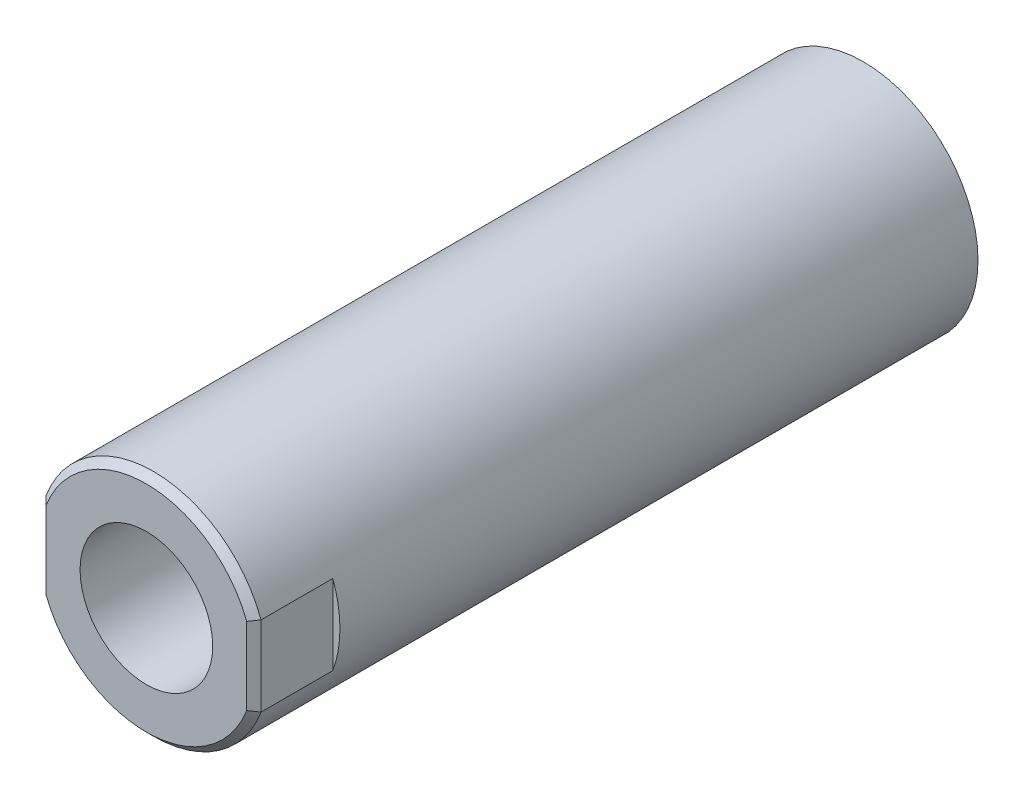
ISO-10303-21;
HEADER;
FILE_DESCRIPTION(('STEP AP214'),'2;1');
FILE_NAME('part.step','',(''),(''),'','','');
FILE_SCHEMA(('AUTOMOTIVE_DESIGN { 1 0 10303 214 1 1 1 1 }'));
ENDSEC;
DATA;
#1=APPLICATION_CONTEXT('core data for automotive mechanical design processes');
#2=APPLICATION_PROTOCOL_DEFINITION('international standard','automotive_design',2000,#1);
#3=PRODUCT_CONTEXT('',#1,'mechanical');
#4=PRODUCT('Part','Part','',(#3));
#5=PRODUCT_RELATED_PRODUCT_CATEGORY('part','',(#4));
#6=PRODUCT_DEFINITION_FORMATION('','',#4);
#7=PRODUCT_DEFINITION_CONTEXT('part definition',#1,'design');
#8=PRODUCT_DEFINITION('design','',#6,#7);
#9=PRODUCT_DEFINITION_SHAPE('','',#8);
#10=(LENGTH_UNIT() NAMED_UNIT(*) SI_UNIT(.MILLI.,.METRE.));
#11=(NAMED_UNIT(*) PLANE_ANGLE_UNIT() SI_UNIT($,.RADIAN.));
#12=(NAMED_UNIT(*) SI_UNIT($,.STERADIAN.) SOLID_ANGLE_UNIT());
#13=UNCERTAINTY_MEASURE_WITH_UNIT(LENGTH_MEASURE(1.E-05),#10,'distance_accuracy_value','');
#14=(GEOMETRIC_REPRESENTATION_CONTEXT(3) GLOBAL_UNCERTAINTY_ASSIGNED_CONTEXT((#13)) GLOBAL_UNIT_ASSIGNED_CONTEXT((#10,
#11,#12)) REPRESENTATION_CONTEXT('',''));
#15=CARTESIAN_POINT('',(0.,0.,0.));
#16=DIRECTION('',(0.,0.,1.));
#17=DIRECTION('',(1.,0.,0.));
#18=AXIS2_PLACEMENT_3D('',#15,#16,#17);
#19=CARTESIAN_POINT('',(0.,0.,-100.));
#20=DIRECTION('',(0.,0.,1.));
#21=DIRECTION('',(1.,0.,0.));
#22=AXIS2_PLACEMENT_3D('',#19,#20,#21);
#23=PLANE('',#22);
#24=CARTESIAN_POINT('',(0.,0.,-100.));
#25=DIRECTION('',(0.,0.,1.));
#26=DIRECTION('',(1.,0.,0.));
#27=AXIS2_PLACEMENT_3D('',#24,#25,#26);
#28=CIRCLE('',#27,16.);
#29=CARTESIAN_POINT('',(16.,0.,-100.));
#30=VERTEX_POINT('',#29);
#31=EDGE_CURVE('E210',#30,#30,#28,.T.);
#32=ORIENTED_EDGE('',*,*,#31,.F.);
#33=EDGE_LOOP('',(#32));
#34=FACE_BOUND('',#33,.T.);
#35=ADVANCED_FACE('F39',(#34),#23,.F.);
#36=CARTESIAN_POINT('',(15.,-10.5,-11.));
#37=DIRECTION('',(0.,0.,-1.));
#38=DIRECTION('',(-1.,0.,0.));
#39=AXIS2_PLACEMENT_3D('',#36,#37,#38);
#40=PLANE('',#39);
#41=CARTESIAN_POINT('',(0.,0.,-11.));
#42=DIRECTION('',(0.,0.,-1.));
#43=DIRECTION('',(-1.,0.,0.));
#44=AXIS2_PLACEMENT_3D('',#41,#42,#43);
#45=CIRCLE('',#44,16.);
#46=CARTESIAN_POINT('',(15.,-5.56776436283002,-11.));
#47=VERTEX_POINT('',#46);
#48=CARTESIAN_POINT('',(15.,5.56776436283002,-11.));
#49=VERTEX_POINT('',#48);
#50=EDGE_CURVE('E213',#47,#49,#45,.F.);
#51=ORIENTED_EDGE('',*,*,#50,.T.);
#52=DIRECTION('',(0.,1.,0.));
#53=VECTOR('',#52,1.);
#54=CARTESIAN_POINT('',(15.,-10.5,-11.));
#55=LINE('',#54,#53);
#56=EDGE_CURVE('E113',#47,#49,#55,.T.);
#57=ORIENTED_EDGE('',*,*,#56,.F.);
#58=EDGE_LOOP('',(#51,#57));
#59=FACE_BOUND('',#58,.T.);
#60=ADVANCED_FACE('F170',(#59),#40,.F.);
#61=CARTESIAN_POINT('',(-17.5,-10.5,-11.));
#62=DIRECTION('',(0.,0.,-1.));
#63=DIRECTION('',(-1.,0.,0.));
#64=AXIS2_PLACEMENT_3D('',#61,#62,#63);
#65=PLANE('',#64);
#66=CARTESIAN_POINT('',(0.,0.,-11.));
#67=DIRECTION('',(0.,0.,-1.));
#68=DIRECTION('',(-1.,0.,0.));
#69=AXIS2_PLACEMENT_3D('',#66,#67,#68);
#70=CIRCLE('',#69,16.);
#71=CARTESIAN_POINT('',(-15.,5.56776436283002,-11.));
#72=VERTEX_POINT('',#71);
#73=CARTESIAN_POINT('',(-15.,-5.56776436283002,-11.));
#74=VERTEX_POINT('',#73);
#75=EDGE_CURVE('E108',#72,#74,#70,.F.);
#76=ORIENTED_EDGE('',*,*,#75,.T.);
#77=DIRECTION('',(0.,1.,0.));
#78=VECTOR('',#77,1.);
#79=CARTESIAN_POINT('',(-15.,-10.5,-11.));
#80=LINE('',#79,#78);
#81=EDGE_CURVE('E103',#74,#72,#80,.T.);
#82=ORIENTED_EDGE('',*,*,#81,.T.);
#83=EDGE_LOOP('',(#76,#82));
#84=FACE_BOUND('',#83,.T.);
#85=ADVANCED_FACE('F111',(#84),#65,.F.);
#86=CARTESIAN_POINT('',(0.,0.,-100.));
#87=DIRECTION('',(0.,0.,1.));
#88=DIRECTION('',(1.,0.,0.));
#89=AXIS2_PLACEMENT_3D('',#86,#87,#88);
#90=CYLINDRICAL_SURFACE('',#89,16.);
#91=DIRECTION('',(0.,0.,1.));
#92=VECTOR('',#91,1.);
#93=CARTESIAN_POINT('',(-15.,5.56776436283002,-100.));
#94=LINE('',#93,#92);
#95=CARTESIAN_POINT('',(-15.,5.56776436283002,-1.));
#96=VERTEX_POINT('',#95);
#97=EDGE_CURVE('E99',#96,#72,#94,.F.);
#98=ORIENTED_EDGE('',*,*,#97,.F.);
#99=CARTESIAN_POINT('',(0.,0.,-1.));
#100=DIRECTION('',(0.,0.,1.));
#101=DIRECTION('',(1.,0.,0.));
#102=AXIS2_PLACEMENT_3D('',#99,#100,#101);
#103=CIRCLE('',#102,16.);
#104=CARTESIAN_POINT('',(15.,5.56776436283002,-1.));
#105=VERTEX_POINT('',#104);
#106=EDGE_CURVE('E52',#96,#105,#103,.F.);
#107=ORIENTED_EDGE('',*,*,#106,.T.);
#108=DIRECTION('',(0.,0.,1.));
#109=VECTOR('',#108,1.);
#110=CARTESIAN_POINT('',(15.,5.56776436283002,-100.));
#111=LINE('',#110,#109);
#112=EDGE_CURVE('E219',#49,#105,#111,.T.);
#113=ORIENTED_EDGE('',*,*,#112,.F.);
#114=ORIENTED_EDGE('',*,*,#50,.F.);
#115=DIRECTION('',(0.,0.,1.));
#116=VECTOR('',#115,1.);
#117=CARTESIAN_POINT('',(15.,-5.56776436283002,-100.));
#118=LINE('',#117,#116);
#119=CARTESIAN_POINT('',(15.,-5.56776436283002,-1.));
#120=VERTEX_POINT('',#119);
#121=EDGE_CURVE('E120',#120,#47,#118,.F.);
#122=ORIENTED_EDGE('',*,*,#121,.F.);
#123=CARTESIAN_POINT('',(0.,0.,-1.));
#124=DIRECTION('',(0.,0.,1.));
#125=DIRECTION('',(1.,0.,0.));
#126=AXIS2_PLACEMENT_3D('',#123,#124,#125);
#127=CIRCLE('',#126,16.);
#128=CARTESIAN_POINT('',(-15.,-5.56776436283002,-1.));
#129=VERTEX_POINT('',#128);
#130=EDGE_CURVE('E134',#120,#129,#127,.F.);
#131=ORIENTED_EDGE('',*,*,#130,.T.);
#132=DIRECTION('',(0.,0.,1.));
#133=VECTOR('',#132,1.);
#134=CARTESIAN_POINT('',(-15.,-5.56776436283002,-100.));
#135=LINE('',#134,#133);
#136=EDGE_CURVE('E118',#74,#129,#135,.T.);
#137=ORIENTED_EDGE('',*,*,#136,.F.);
#138=ORIENTED_EDGE('',*,*,#75,.F.);
#139=EDGE_LOOP('',(#98,#107,#113,#114,#122,#131,#137,#138));
#140=FACE_BOUND('',#139,.T.);
#141=ORIENTED_EDGE('',*,*,#31,.T.);
#142=EDGE_LOOP('',(#141));
#143=FACE_BOUND('',#142,.T.);
#144=ADVANCED_FACE('F116',(#140,#143),#90,.T.);
#145=CARTESIAN_POINT('',(15.,-10.5,0.));
#146=DIRECTION('',(-1.,0.,0.));
#147=DIRECTION('',(0.,0.,1.));
#148=AXIS2_PLACEMENT_3D('',#145,#146,#147);
#149=PLANE('',#148);
#150=ORIENTED_EDGE('',*,*,#112,.T.);
#151=DIRECTION('',(0.,-1.,0.));
#152=VECTOR('',#151,1.);
#153=CARTESIAN_POINT('',(15.,-5.56776436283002,-0.999999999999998));
#154=LINE('',#153,#152);
#155=EDGE_CURVE('E11',#105,#120,#154,.T.);
#156=ORIENTED_EDGE('',*,*,#155,.T.);
#157=ORIENTED_EDGE('',*,*,#121,.T.);
#158=ORIENTED_EDGE('',*,*,#56,.T.);
#159=EDGE_LOOP('',(#150,#156,#157,#158));
#160=FACE_BOUND('',#159,.T.);
#161=ADVANCED_FACE('F183',(#160),#149,.F.);
#162=CARTESIAN_POINT('',(-15.,-10.5,0.));
#163=DIRECTION('',(1.,0.,0.));
#164=DIRECTION('',(0.,0.,-1.));
#165=AXIS2_PLACEMENT_3D('',#162,#163,#164);
#166=PLANE('',#165);
#167=ORIENTED_EDGE('',*,*,#136,.T.);
#168=DIRECTION('',(0.,1.,0.));
#169=VECTOR('',#168,1.);
#170=CARTESIAN_POINT('',(-15.,5.56776436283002,-0.999999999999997));
#171=LINE('',#170,#169);
#172=EDGE_CURVE('E106',#129,#96,#171,.T.);
#173=ORIENTED_EDGE('',*,*,#172,.T.);
#174=ORIENTED_EDGE('',*,*,#97,.T.);
#175=ORIENTED_EDGE('',*,*,#81,.F.);
#176=EDGE_LOOP('',(#167,#173,#174,#175));
#177=FACE_BOUND('',#176,.T.);
#178=ADVANCED_FACE('F102',(#177),#166,.F.);
#179=CARTESIAN_POINT('',(0.,0.,0.));
#180=DIRECTION('',(0.,0.,1.));
#181=DIRECTION('',(1.,0.,0.));
#182=AXIS2_PLACEMENT_3D('',#179,#180,#181);
#183=PLANE('',#182);
#184=CARTESIAN_POINT('',(0.,0.,0.));
#185=DIRECTION('',(0.,0.,1.));
#186=DIRECTION('',(1.,0.,0.));
#187=AXIS2_PLACEMENT_3D('',#184,#185,#186);
#188=CIRCLE('',#187,15.);
#189=CARTESIAN_POINT('',(14.,5.38516480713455,0.));
#190=VERTEX_POINT('',#189);
#191=CARTESIAN_POINT('',(-14.,5.38516480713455,0.));
#192=VERTEX_POINT('',#191);
#193=EDGE_CURVE('E129',#190,#192,#188,.T.);
#194=ORIENTED_EDGE('',*,*,#193,.T.);
#195=DIRECTION('',(0.,-1.,0.));
#196=VECTOR('',#195,1.);
#197=CARTESIAN_POINT('',(-14.,-5.56776436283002,0.));
#198=LINE('',#197,#196);
#199=CARTESIAN_POINT('',(-14.,-5.38516480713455,0.));
#200=VERTEX_POINT('',#199);
#201=EDGE_CURVE('E131',#192,#200,#198,.T.);
#202=ORIENTED_EDGE('',*,*,#201,.T.);
#203=CARTESIAN_POINT('',(0.,0.,0.));
#204=DIRECTION('',(0.,0.,1.));
#205=DIRECTION('',(1.,0.,0.));
#206=AXIS2_PLACEMENT_3D('',#203,#204,#205);
#207=CIRCLE('',#206,15.);
#208=CARTESIAN_POINT('',(14.,-5.38516480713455,0.));
#209=VERTEX_POINT('',#208);
#210=EDGE_CURVE('E125',#200,#209,#207,.T.);
#211=ORIENTED_EDGE('',*,*,#210,.T.);
#212=DIRECTION('',(0.,1.,0.));
#213=VECTOR('',#212,1.);
#214=CARTESIAN_POINT('',(14.,5.56776436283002,0.));
#215=LINE('',#214,#213);
#216=EDGE_CURVE('E127',#209,#190,#215,.T.);
#217=ORIENTED_EDGE('',*,*,#216,.T.);
#218=EDGE_LOOP('',(#194,#202,#211,#217));
#219=FACE_BOUND('',#218,.T.);
#220=CARTESIAN_POINT('',(0.,0.,0.));
#221=DIRECTION('',(0.,0.,-1.));
#222=DIRECTION('',(-1.,0.,0.));
#223=AXIS2_PLACEMENT_3D('',#220,#221,#222);
#224=CIRCLE('',#223,9.24999999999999);
#225=CARTESIAN_POINT('',(-9.24999999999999,0.,0.));
#226=VERTEX_POINT('',#225);
#227=EDGE_CURVE('E114',#226,#226,#224,.F.);
#228=ORIENTED_EDGE('',*,*,#227,.F.);
#229=EDGE_LOOP('',(#228));
#230=FACE_BOUND('',#229,.T.);
#231=ADVANCED_FACE('F195',(#219,#230),#183,.T.);
#232=CARTESIAN_POINT('',(0.,0.,14.));
#233=DIRECTION('',(0.,0.,1.));
#234=DIRECTION('',(1.,0.,0.));
#235=AXIS2_PLACEMENT_3D('',#232,#233,#234);
#236=CYLINDRICAL_SURFACE('',#235,9.24999999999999);
#237=ORIENTED_EDGE('',*,*,#227,.T.);
#238=EDGE_LOOP('',(#237));
#239=FACE_BOUND('',#238,.T.);
#240=CARTESIAN_POINT('',(0.,0.,-15.5));
#241=DIRECTION('',(0.,0.,1.));
#242=DIRECTION('',(1.,0.,0.));
#243=AXIS2_PLACEMENT_3D('',#240,#241,#242);
#244=CIRCLE('',#243,9.24999999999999);
#245=CARTESIAN_POINT('',(9.24999999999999,0.,-15.5));
#246=VERTEX_POINT('',#245);
#247=EDGE_CURVE('E208',#246,#246,#244,.T.);
#248=ORIENTED_EDGE('',*,*,#247,.F.);
#249=EDGE_LOOP('',(#248));
#250=FACE_BOUND('',#249,.T.);
#251=ADVANCED_FACE('F180',(#239,#250),#236,.F.);
#252=CARTESIAN_POINT('',(0.,0.,-15.5));
#253=DIRECTION('',(0.,0.,1.));
#254=DIRECTION('',(1.,0.,0.));
#255=AXIS2_PLACEMENT_3D('',#252,#253,#254);
#256=CONICAL_SURFACE('',#255,9.24999999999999,1.02974425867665);
#257=CARTESIAN_POINT('',(0.,0.,-21.0579607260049));
#258=VERTEX_POINT('',#257);
#259=VERTEX_LOOP('',#258);
#260=FACE_BOUND('',#259,.T.);
#261=ORIENTED_EDGE('',*,*,#247,.T.);
#262=EDGE_LOOP('',(#261));
#263=FACE_BOUND('',#262,.T.);
#264=ADVANCED_FACE('F166',(#260,#263),#256,.F.);
#265=CARTESIAN_POINT('',(14.,0.,0.));
#266=DIRECTION('',(0.707106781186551,0.,0.707106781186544));
#267=DIRECTION('',(0.707106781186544,0.,-0.707106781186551));
#268=AXIS2_PLACEMENT_3D('',#265,#266,#267);
#269=PLANE('',#268);
#270=CARTESIAN_POINT('',(15.,5.56776436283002,-1.));
#271=CARTESIAN_POINT('',(14.8332877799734,5.5378301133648,-0.833287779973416));
#272=CARTESIAN_POINT('',(14.6665983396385,5.50764635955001,-0.666598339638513));
#273=CARTESIAN_POINT('',(14.3332650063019,5.44677984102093,-0.333265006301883));
#274=CARTESIAN_POINT('',(14.1666211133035,5.41609707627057,-0.166621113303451));
#275=CARTESIAN_POINT('',(14.,5.38516480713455,0.));
#276=B_SPLINE_CURVE_WITH_KNOTS('',3,(#270,#271,#272,#273,#274,#275),.UNSPECIFIED.,.F.,.F.,(4,2,
4),(0.,0.712976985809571,1.42595402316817),.UNSPECIFIED.);
#277=EDGE_CURVE('E226',#190,#105,#276,.F.);
#278=ORIENTED_EDGE('',*,*,#277,.F.);
#279=ORIENTED_EDGE('',*,*,#216,.F.);
#280=CARTESIAN_POINT('',(15.,-5.56776436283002,-1.));
#281=CARTESIAN_POINT('',(14.8332877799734,-5.5378301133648,-0.833287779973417));
#282=CARTESIAN_POINT('',(14.6665983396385,-5.50764635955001,-0.666598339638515));
#283=CARTESIAN_POINT('',(14.3332650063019,-5.44677984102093,-0.333265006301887));
#284=CARTESIAN_POINT('',(14.1666211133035,-5.41609707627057,-0.166621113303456));
#285=CARTESIAN_POINT('',(14.,-5.38516480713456,0.));
#286=B_SPLINE_CURVE_WITH_KNOTS('',3,(#280,#281,#282,#283,#284,#285),.UNSPECIFIED.,.F.,.F.,(4,2,
4),(0.,0.712976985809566,1.42595402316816),.UNSPECIFIED.);
#287=EDGE_CURVE('E44',#120,#209,#286,.T.);
#288=ORIENTED_EDGE('',*,*,#287,.F.);
#289=ORIENTED_EDGE('',*,*,#155,.F.);
#290=EDGE_LOOP('',(#278,#279,#288,#289));
#291=FACE_BOUND('',#290,.T.);
#292=ADVANCED_FACE('F41',(#291),#269,.T.);
#293=CARTESIAN_POINT('',(0.,0.,0.));
#294=DIRECTION('',(0.,0.,-1.));
#295=DIRECTION('',(-1.,0.,0.));
#296=AXIS2_PLACEMENT_3D('',#293,#294,#295);
#297=CONICAL_SURFACE('',#296,15.,0.785398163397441);
#298=ORIENTED_EDGE('',*,*,#287,.T.);
#299=ORIENTED_EDGE('',*,*,#210,.F.);
#300=CARTESIAN_POINT('',(-14.,-5.38516480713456,0.));
#301=CARTESIAN_POINT('',(-14.1666211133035,-5.41609707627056,-0.166621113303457));
#302=CARTESIAN_POINT('',(-14.3332650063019,-5.44677984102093,-0.333265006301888));
#303=CARTESIAN_POINT('',(-14.6665983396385,-5.50764635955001,-0.666598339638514));
#304=CARTESIAN_POINT('',(-14.8332877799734,-5.53783011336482,-0.833287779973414));
#305=CARTESIAN_POINT('',(-15.,-5.56776436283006,-0.999999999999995));
#306=B_SPLINE_CURVE_WITH_KNOTS('',3,(#300,#301,#302,#303,#304,#305),.UNSPECIFIED.,.F.,.F.,(4,2,
4),(0.,0.712977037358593,1.42595402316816),.UNSPECIFIED.);
#307=EDGE_CURVE('E144',#129,#200,#306,.F.);
#308=ORIENTED_EDGE('',*,*,#307,.F.);
#309=ORIENTED_EDGE('',*,*,#130,.F.);
#310=EDGE_LOOP('',(#298,#299,#308,#309));
#311=FACE_BOUND('',#310,.T.);
#312=ADVANCED_FACE('F155',(#311),#297,.T.);
#313=CARTESIAN_POINT('',(0.,0.,0.));
#314=DIRECTION('',(0.,0.,-1.));
#315=DIRECTION('',(-1.,0.,0.));
#316=AXIS2_PLACEMENT_3D('',#313,#314,#315);
#317=CONICAL_SURFACE('',#316,15.,0.785398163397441);
#318=ORIENTED_EDGE('',*,*,#277,.T.);
#319=ORIENTED_EDGE('',*,*,#106,.F.);
#320=CARTESIAN_POINT('',(-15.,5.56776436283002,-1.));
#321=CARTESIAN_POINT('',(-14.8332877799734,5.5378301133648,-0.833287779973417));
#322=CARTESIAN_POINT('',(-14.6665983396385,5.50764635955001,-0.666598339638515));
#323=CARTESIAN_POINT('',(-14.3332650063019,5.44677984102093,-0.333265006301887));
#324=CARTESIAN_POINT('',(-14.1666211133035,5.41609707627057,-0.166621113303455));
#325=CARTESIAN_POINT('',(-14.,5.38516480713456,0.));
#326=B_SPLINE_CURVE_WITH_KNOTS('',3,(#320,#321,#322,#323,#324,#325),.UNSPECIFIED.,.F.,.F.,(4,2,
4),(0.,0.712976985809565,1.42595402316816),.UNSPECIFIED.);
#327=EDGE_CURVE('E137',#192,#96,#326,.F.);
#328=ORIENTED_EDGE('',*,*,#327,.F.);
#329=ORIENTED_EDGE('',*,*,#193,.F.);
#330=EDGE_LOOP('',(#318,#319,#328,#329));
#331=FACE_BOUND('',#330,.T.);
#332=ADVANCED_FACE('F148',(#331),#317,.T.);
#333=CARTESIAN_POINT('',(-15.,-10.5,-0.999999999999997));
#334=DIRECTION('',(-0.707106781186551,0.,0.707106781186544));
#335=DIRECTION('',(0.707106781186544,0.,0.707106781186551));
#336=AXIS2_PLACEMENT_3D('',#333,#334,#335);
#337=PLANE('',#336);
#338=ORIENTED_EDGE('',*,*,#307,.T.);
#339=ORIENTED_EDGE('',*,*,#201,.F.);
#340=ORIENTED_EDGE('',*,*,#327,.T.);
#341=ORIENTED_EDGE('',*,*,#172,.F.);
#342=EDGE_LOOP('',(#338,#339,#340,#341));
#343=FACE_BOUND('',#342,.T.);
#344=ADVANCED_FACE('F151',(#343),#337,.T.);
#345=CLOSED_SHELL('',(#35,#60,#85,#144,#161,#178,#231,#251,#264,#292,#312,#332,#344));
#346=MANIFOLD_SOLID_BREP('B2',#345);
#347=ADVANCED_BREP_SHAPE_REPRESENTATION('',(#18,#346),#14);
#348=SHAPE_DEFINITION_REPRESENTATION(#9,#347);
ENDSEC;
END-ISO-10303-21;
